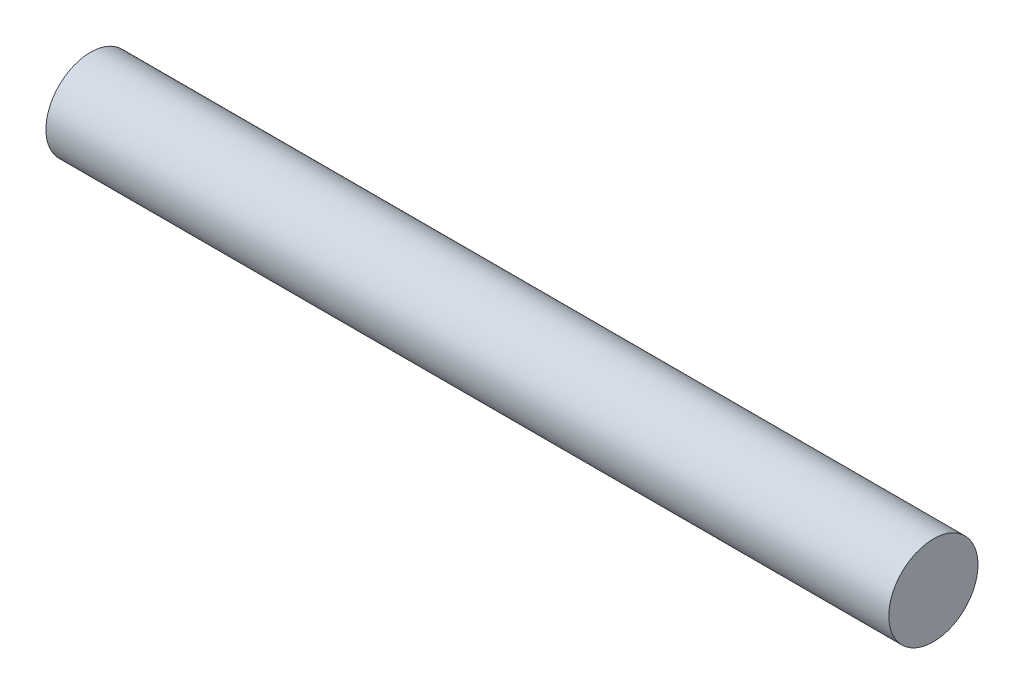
from build123d import *

# Parameters (mm, degrees)
SKETCH1_R           = 1.5875
BOSS_EXTRUDE1_DEPTH = 30


with BuildPart() as part:
    # Sketch1 → Boss-Extrude1 (new body)
    with BuildSketch(Plane(origin=(0, 0, 0), x_dir=(0, 0, -1), z_dir=(1, 0, 0))):
        Circle(SKETCH1_R)
    extrude(amount=BOSS_EXTRUDE1_DEPTH)


solid = part.part
